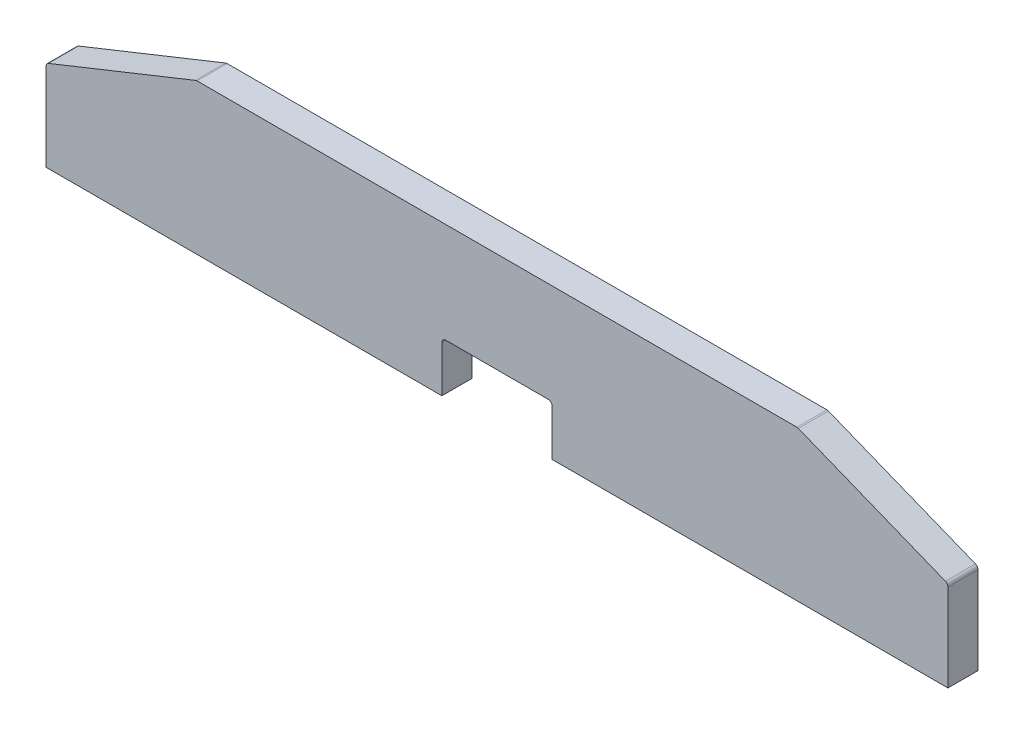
from build123d import *

# Parameters (mm, degrees)
ESTRUSIONE_ESTRUSIONE1_DEPTH = 30
RACCORDO1_R                  = 4
RACCORDO2_R                  = 4
RACCORDO3_R                  = 4
RACCORDO4_R                  = 4
RACCORDO5_R                  = 4
RACCORDO6_R                  = 4
SKETCH1_W                    = 20
SKETCH1_H                    = 20
CUT_EXTRUDE1_DEPTH           = 20


with BuildPart() as part:
    # Schizzo1 → Estrusione-Estrusione1 (new body)
    with BuildSketch(Plane.XY):
        Polygon((-450, -50), (-55, -50), (-55, 0), (55, 0), (55, -50), (450, -50), (450, 40), (300, 100), (-300, 100), (-450, 40), align=None)
    extrude(amount=ESTRUSIONE_ESTRUSIONE1_DEPTH)

    # Raccordo1
    raccordo1_edges = [part.edges().sort_by_distance(p)[0] for p in [
        (55, 0, 15),
    ]]
    fillet(raccordo1_edges, radius=RACCORDO1_R)

    # Raccordo2
    raccordo2_edges = [part.edges().sort_by_distance(p)[0] for p in [
        (-55, 0, 15),
    ]]
    fillet(raccordo2_edges, radius=RACCORDO2_R)

    # Raccordo3
    raccordo3_edges = [part.edges().sort_by_distance(p)[0] for p in [
        (300, 100, 15),
    ]]
    fillet(raccordo3_edges, radius=RACCORDO3_R)

    # Raccordo4
    raccordo4_edges = [part.edges().sort_by_distance(p)[0] for p in [
        (450, 40, 15),
    ]]
    fillet(raccordo4_edges, radius=RACCORDO4_R)

    # Raccordo5
    raccordo5_edges = [part.edges().sort_by_distance(p)[0] for p in [
        (-300, 100, 15),
    ]]
    fillet(raccordo5_edges, radius=RACCORDO5_R)

    # Raccordo6
    raccordo6_edges = [part.edges().sort_by_distance(p)[0] for p in [
        (-450, 40, 15),
    ]]
    fillet(raccordo6_edges, radius=RACCORDO6_R)

    # Sketch1 → Cut-Extrude1 (cut)
    with BuildSketch(Plane.XY):
        with Locations((-290, 62)):
            Rectangle(SKETCH1_W, SKETCH1_H)
        with Locations((-290, 0)):
            Rectangle(SKETCH1_W, SKETCH1_H)
        with Locations((-115, 62)):
            Rectangle(SKETCH1_W, SKETCH1_H)
        with Locations((290, 0)):
            Rectangle(SKETCH1_W, SKETCH1_H)
        with Locations((115, 0)):
            Rectangle(SKETCH1_W, SKETCH1_H)
        with Locations((115, 62)):
            Rectangle(SKETCH1_W, SKETCH1_H)
        with Locations((-115, 0)):
            Rectangle(SKETCH1_W, SKETCH1_H)
        with Locations((290, 62)):
            Rectangle(SKETCH1_W, SKETCH1_H)
    extrude(amount=CUT_EXTRUDE1_DEPTH, mode=Mode.SUBTRACT)


solid = part.part
